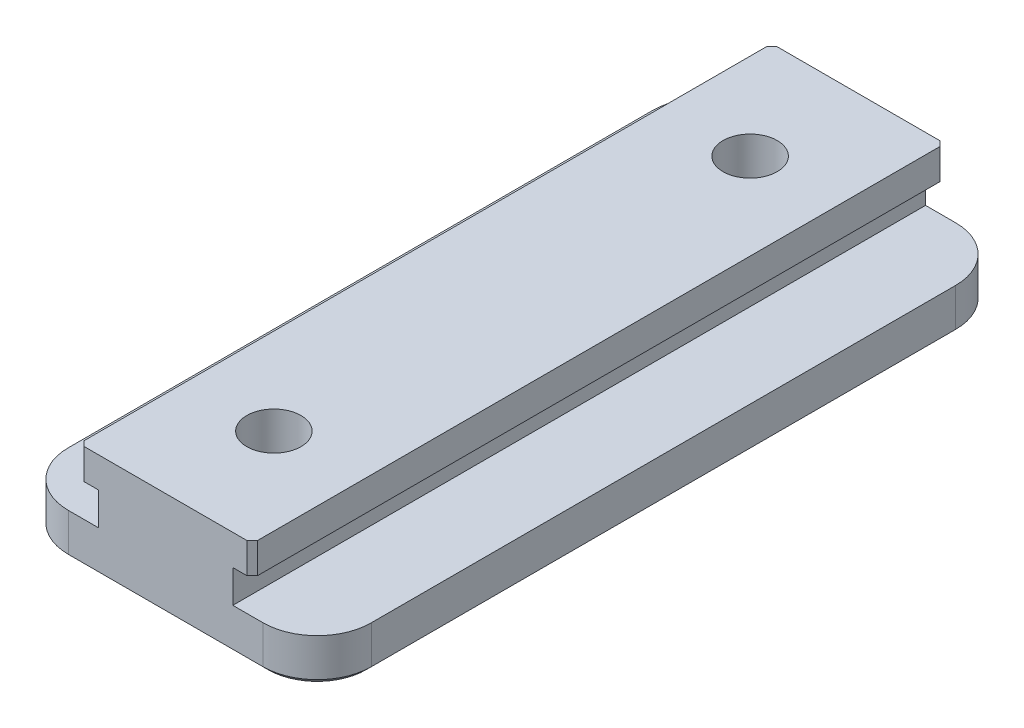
from build123d import *

# Parameters (mm, degrees)
BOSS_EXTRUDE1_DEPTH = 50.8
FILLET1_R           = 7.9502
CHAMFER1_SIZE       = 0.762
CHAMFER3_SIZE       = 0.762
TAPPED_HOLE1_D      = 7.9375


with BuildPart() as part:
    # Sketch1 → Boss-Extrude1 (new, symmetric)
    with BuildSketch(Plane.XY):
        Polygon((12.7, 6.096), (-12.7, 6.096), (-12.7, 1.6256), (-9.8552, 1.6256), (-9.8552, -3.175), (-22.225, -3.175), (-22.225, -9.525), (22.225, -9.525), (22.225, -3.175), (9.8552, -3.175), (9.8552, 1.6256), (12.7, 1.6256), align=None)
    extrude(amount=BOSS_EXTRUDE1_DEPTH, both=True)

    # Fillet1
    fillet1_edges = [part.edges().sort_by_distance(p)[0] for p in [
        (22.225, -6.35, -50.8),
        (-22.225, -6.35, -50.8),
        (-22.225, -6.35, 50.8),
        (22.225, -6.35, 50.8),
    ]]
    fillet(fillet1_edges, radius=FILLET1_R)

    # Chamfer1
    chamfer1_edges = [part.edges().sort_by_distance(p)[0] for p in [
        (0, -9.525, 50.8),
        (0, -9.525, -50.8),
        (22.225, -9.525, 0),
        (-22.225, -9.525, 0),
        (19.896440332, -9.525, 48.471440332),
        (19.896440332, -9.525, -48.471440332),
        (-19.896440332, -9.525, -48.471440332),
        (-19.896440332, -9.525, 48.471440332),
    ]]
    chamfer(chamfer1_edges, length=CHAMFER1_SIZE)

    # Chamfer3
    chamfer3_edges = [part.edges().sort_by_distance(p)[0] for p in [
        (12.7, 3.8608, -50.8),
        (-12.7, 3.8608, -50.8),
        (12.7, 3.8608, 50.8),
        (-12.7, 3.8608, 50.8),
    ]]
    chamfer(chamfer3_edges, length=CHAMFER3_SIZE)

    # Tapped Hole1 (through all)
    with Locations(Plane(origin=(0, -9.525, 0), x_dir=(-1, 0, 0), z_dir=(0, -1, 0))):
        with Locations((0, 34.925)):
            tapped_hole1 = Hole(TAPPED_HOLE1_D / 2)

    # Mirror1: Tapped Hole1 across plane
    add(tapped_hole1.mirror(Plane.XY), mode=Mode.SUBTRACT)


solid = part.part
